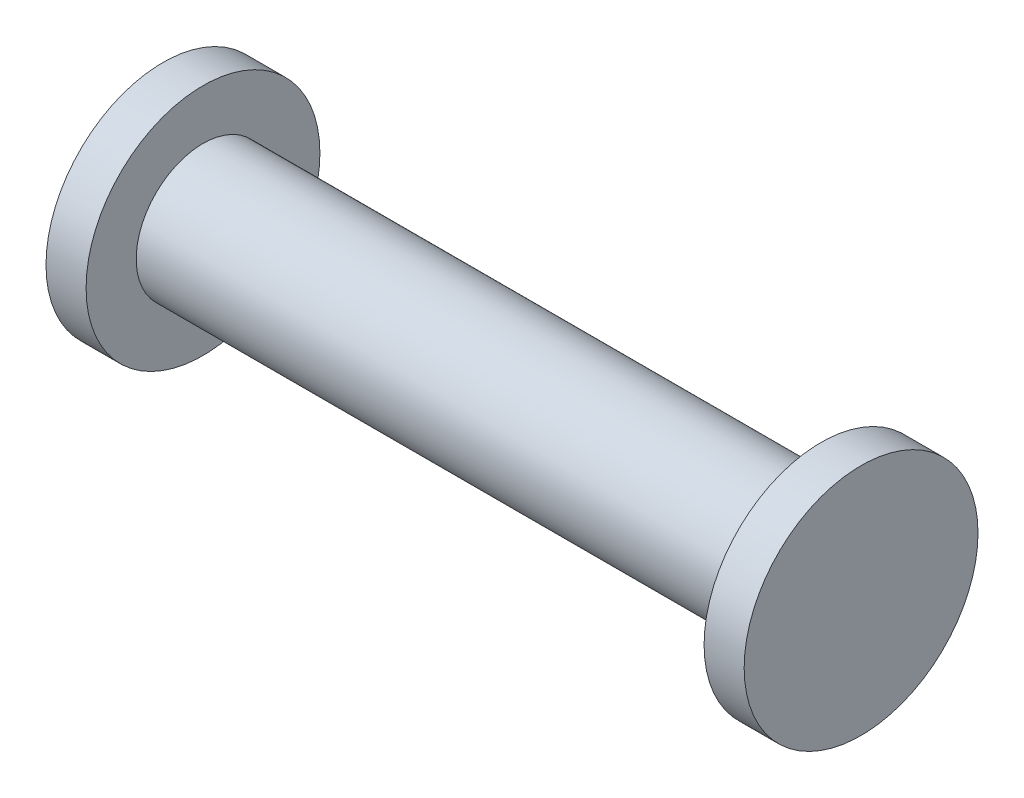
ISO-10303-21;
HEADER;
FILE_DESCRIPTION(('STEP AP214'),'2;1');
FILE_NAME('part.step','',(''),(''),'','','');
FILE_SCHEMA(('AUTOMOTIVE_DESIGN { 1 0 10303 214 1 1 1 1 }'));
ENDSEC;
DATA;
#1=APPLICATION_CONTEXT('core data for automotive mechanical design processes');
#2=APPLICATION_PROTOCOL_DEFINITION('international standard','automotive_design',2000,#1);
#3=PRODUCT_CONTEXT('',#1,'mechanical');
#4=PRODUCT('Part','Part','',(#3));
#5=PRODUCT_RELATED_PRODUCT_CATEGORY('part','',(#4));
#6=PRODUCT_DEFINITION_FORMATION('','',#4);
#7=PRODUCT_DEFINITION_CONTEXT('part definition',#1,'design');
#8=PRODUCT_DEFINITION('design','',#6,#7);
#9=PRODUCT_DEFINITION_SHAPE('','',#8);
#10=(LENGTH_UNIT() NAMED_UNIT(*) SI_UNIT(.MILLI.,.METRE.));
#11=(NAMED_UNIT(*) PLANE_ANGLE_UNIT() SI_UNIT($,.RADIAN.));
#12=(NAMED_UNIT(*) SI_UNIT($,.STERADIAN.) SOLID_ANGLE_UNIT());
#13=UNCERTAINTY_MEASURE_WITH_UNIT(LENGTH_MEASURE(1.E-05),#10,'distance_accuracy_value','');
#14=(GEOMETRIC_REPRESENTATION_CONTEXT(3) GLOBAL_UNCERTAINTY_ASSIGNED_CONTEXT((#13)) GLOBAL_UNIT_ASSIGNED_CONTEXT((#10,
#11,#12)) REPRESENTATION_CONTEXT('',''));
#15=CARTESIAN_POINT('',(0.,0.,0.));
#16=DIRECTION('',(0.,0.,1.));
#17=DIRECTION('',(1.,0.,0.));
#18=AXIS2_PLACEMENT_3D('',#15,#16,#17);
#19=CARTESIAN_POINT('',(-9.25,0.,0.));
#20=DIRECTION('',(1.,0.,0.));
#21=DIRECTION('',(0.,0.,-1.));
#22=AXIS2_PLACEMENT_3D('',#19,#20,#21);
#23=CYLINDRICAL_SURFACE('',#22,2.);
#24=CARTESIAN_POINT('',(-9.25,0.,0.));
#25=DIRECTION('',(1.,0.,0.));
#26=DIRECTION('',(0.,0.,-1.));
#27=AXIS2_PLACEMENT_3D('',#24,#25,#26);
#28=CIRCLE('',#27,2.);
#29=CARTESIAN_POINT('',(-9.25,0.,-2.));
#30=VERTEX_POINT('',#29);
#31=EDGE_CURVE('E52',#30,#30,#28,.T.);
#32=ORIENTED_EDGE('',*,*,#31,.T.);
#33=EDGE_LOOP('',(#32));
#34=FACE_BOUND('',#33,.T.);
#35=CARTESIAN_POINT('',(9.25,0.,0.));
#36=DIRECTION('',(1.,0.,0.));
#37=DIRECTION('',(0.,0.,-1.));
#38=AXIS2_PLACEMENT_3D('',#35,#36,#37);
#39=CIRCLE('',#38,2.);
#40=CARTESIAN_POINT('',(9.25,0.,-2.));
#41=VERTEX_POINT('',#40);
#42=EDGE_CURVE('E10',#41,#41,#39,.T.);
#43=ORIENTED_EDGE('',*,*,#42,.F.);
#44=EDGE_LOOP('',(#43));
#45=FACE_BOUND('',#44,.T.);
#46=ADVANCED_FACE('F37',(#34,#45),#23,.T.);
#47=CARTESIAN_POINT('',(10.45,0.,0.));
#48=DIRECTION('',(-1.,0.,0.));
#49=DIRECTION('',(0.,0.,1.));
#50=AXIS2_PLACEMENT_3D('',#47,#48,#49);
#51=CYLINDRICAL_SURFACE('',#50,3.5);
#52=CARTESIAN_POINT('',(10.45,0.,0.));
#53=DIRECTION('',(1.,0.,0.));
#54=DIRECTION('',(0.,0.,-1.));
#55=AXIS2_PLACEMENT_3D('',#52,#53,#54);
#56=CIRCLE('',#55,3.5);
#57=CARTESIAN_POINT('',(10.45,0.,-3.5));
#58=VERTEX_POINT('',#57);
#59=EDGE_CURVE('E43',#58,#58,#56,.T.);
#60=ORIENTED_EDGE('',*,*,#59,.F.);
#61=EDGE_LOOP('',(#60));
#62=FACE_BOUND('',#61,.T.);
#63=CARTESIAN_POINT('',(9.25,0.,0.));
#64=DIRECTION('',(1.,0.,0.));
#65=DIRECTION('',(0.,0.,-1.));
#66=AXIS2_PLACEMENT_3D('',#63,#64,#65);
#67=CIRCLE('',#66,3.5);
#68=CARTESIAN_POINT('',(9.25,0.,-3.5));
#69=VERTEX_POINT('',#68);
#70=EDGE_CURVE('E47',#69,#69,#67,.T.);
#71=ORIENTED_EDGE('',*,*,#70,.T.);
#72=EDGE_LOOP('',(#71));
#73=FACE_BOUND('',#72,.T.);
#74=ADVANCED_FACE('F85',(#62,#73),#51,.T.);
#75=CARTESIAN_POINT('',(10.45,0.,0.));
#76=DIRECTION('',(1.,0.,0.));
#77=DIRECTION('',(0.,0.,-1.));
#78=AXIS2_PLACEMENT_3D('',#75,#76,#77);
#79=PLANE('',#78);
#80=ORIENTED_EDGE('',*,*,#59,.T.);
#81=EDGE_LOOP('',(#80));
#82=FACE_BOUND('',#81,.T.);
#83=ADVANCED_FACE('F80',(#82),#79,.T.);
#84=CARTESIAN_POINT('',(9.25,0.,0.));
#85=DIRECTION('',(1.,0.,0.));
#86=DIRECTION('',(0.,0.,-1.));
#87=AXIS2_PLACEMENT_3D('',#84,#85,#86);
#88=PLANE('',#87);
#89=ORIENTED_EDGE('',*,*,#42,.T.);
#90=EDGE_LOOP('',(#89));
#91=FACE_BOUND('',#90,.T.);
#92=ORIENTED_EDGE('',*,*,#70,.F.);
#93=EDGE_LOOP('',(#92));
#94=FACE_BOUND('',#93,.T.);
#95=ADVANCED_FACE('F72',(#91,#94),#88,.F.);
#96=CARTESIAN_POINT('',(-10.45,0.,0.));
#97=DIRECTION('',(1.,0.,0.));
#98=DIRECTION('',(0.,0.,-1.));
#99=AXIS2_PLACEMENT_3D('',#96,#97,#98);
#100=CYLINDRICAL_SURFACE('',#99,3.5);
#101=CARTESIAN_POINT('',(-10.45,0.,0.));
#102=DIRECTION('',(1.,0.,0.));
#103=DIRECTION('',(0.,0.,-1.));
#104=AXIS2_PLACEMENT_3D('',#101,#102,#103);
#105=CIRCLE('',#104,3.5);
#106=CARTESIAN_POINT('',(-10.45,0.,-3.5));
#107=VERTEX_POINT('',#106);
#108=EDGE_CURVE('E58',#107,#107,#105,.T.);
#109=ORIENTED_EDGE('',*,*,#108,.T.);
#110=EDGE_LOOP('',(#109));
#111=FACE_BOUND('',#110,.T.);
#112=CARTESIAN_POINT('',(-9.25,0.,0.));
#113=DIRECTION('',(1.,0.,0.));
#114=DIRECTION('',(0.,0.,-1.));
#115=AXIS2_PLACEMENT_3D('',#112,#113,#114);
#116=CIRCLE('',#115,3.5);
#117=CARTESIAN_POINT('',(-9.25,0.,-3.5));
#118=VERTEX_POINT('',#117);
#119=EDGE_CURVE('E55',#118,#118,#116,.T.);
#120=ORIENTED_EDGE('',*,*,#119,.F.);
#121=EDGE_LOOP('',(#120));
#122=FACE_BOUND('',#121,.T.);
#123=ADVANCED_FACE('F69',(#111,#122),#100,.T.);
#124=CARTESIAN_POINT('',(-10.45,0.,0.));
#125=DIRECTION('',(1.,0.,0.));
#126=DIRECTION('',(0.,0.,-1.));
#127=AXIS2_PLACEMENT_3D('',#124,#125,#126);
#128=PLANE('',#127);
#129=ORIENTED_EDGE('',*,*,#108,.F.);
#130=EDGE_LOOP('',(#129));
#131=FACE_BOUND('',#130,.T.);
#132=ADVANCED_FACE('F71',(#131),#128,.F.);
#133=CARTESIAN_POINT('',(-9.25,0.,0.));
#134=DIRECTION('',(1.,0.,0.));
#135=DIRECTION('',(0.,0.,-1.));
#136=AXIS2_PLACEMENT_3D('',#133,#134,#135);
#137=PLANE('',#136);
#138=ORIENTED_EDGE('',*,*,#31,.F.);
#139=EDGE_LOOP('',(#138));
#140=FACE_BOUND('',#139,.T.);
#141=ORIENTED_EDGE('',*,*,#119,.T.);
#142=EDGE_LOOP('',(#141));
#143=FACE_BOUND('',#142,.T.);
#144=ADVANCED_FACE('F67',(#140,#143),#137,.T.);
#145=CLOSED_SHELL('',(#46,#74,#83,#95,#123,#132,#144));
#146=MANIFOLD_SOLID_BREP('B2',#145);
#147=ADVANCED_BREP_SHAPE_REPRESENTATION('',(#18,#146),#14);
#148=SHAPE_DEFINITION_REPRESENTATION(#9,#147);
ENDSEC;
END-ISO-10303-21;
